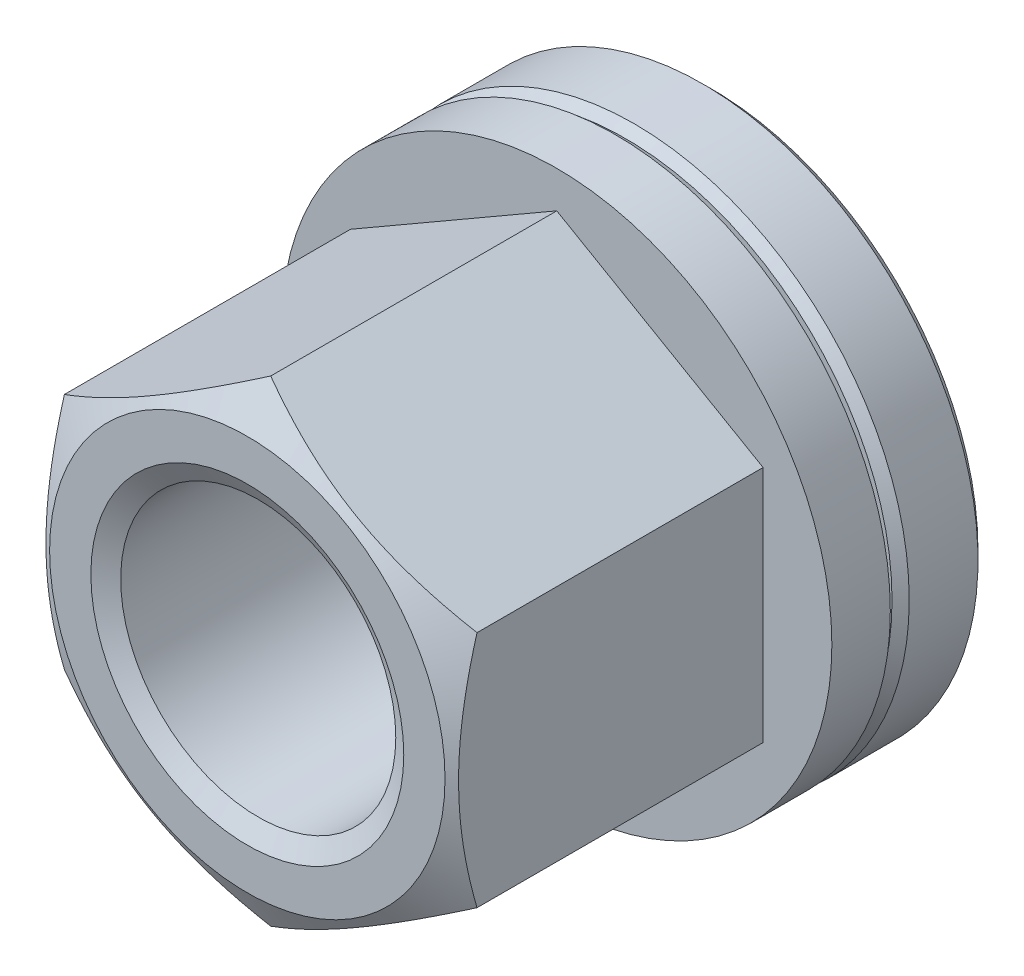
ISO-10303-21;
HEADER;
FILE_DESCRIPTION(('STEP AP214'),'2;1');
FILE_NAME('part.step','',(''),(''),'','','');
FILE_SCHEMA(('AUTOMOTIVE_DESIGN { 1 0 10303 214 1 1 1 1 }'));
ENDSEC;
DATA;
#1=APPLICATION_CONTEXT('core data for automotive mechanical design processes');
#2=APPLICATION_PROTOCOL_DEFINITION('international standard','automotive_design',2000,#1);
#3=PRODUCT_CONTEXT('',#1,'mechanical');
#4=PRODUCT('Part','Part','',(#3));
#5=PRODUCT_RELATED_PRODUCT_CATEGORY('part','',(#4));
#6=PRODUCT_DEFINITION_FORMATION('','',#4);
#7=PRODUCT_DEFINITION_CONTEXT('part definition',#1,'design');
#8=PRODUCT_DEFINITION('design','',#6,#7);
#9=PRODUCT_DEFINITION_SHAPE('','',#8);
#10=(LENGTH_UNIT() NAMED_UNIT(*) SI_UNIT(.MILLI.,.METRE.));
#11=(NAMED_UNIT(*) PLANE_ANGLE_UNIT() SI_UNIT($,.RADIAN.));
#12=(NAMED_UNIT(*) SI_UNIT($,.STERADIAN.) SOLID_ANGLE_UNIT());
#13=UNCERTAINTY_MEASURE_WITH_UNIT(LENGTH_MEASURE(1.E-05),#10,'distance_accuracy_value','');
#14=(GEOMETRIC_REPRESENTATION_CONTEXT(3) GLOBAL_UNCERTAINTY_ASSIGNED_CONTEXT((#13)) GLOBAL_UNIT_ASSIGNED_CONTEXT((#10,
#11,#12)) REPRESENTATION_CONTEXT('',''));
#15=CARTESIAN_POINT('',(0.,0.,0.));
#16=DIRECTION('',(0.,0.,1.));
#17=DIRECTION('',(1.,0.,0.));
#18=AXIS2_PLACEMENT_3D('',#15,#16,#17);
#19=CARTESIAN_POINT('',(0.,0.,0.));
#20=DIRECTION('',(0.,0.,-1.));
#21=DIRECTION('',(-1.,0.,0.));
#22=AXIS2_PLACEMENT_3D('',#19,#20,#21);
#23=CYLINDRICAL_SURFACE('',#22,9.5);
#24=CARTESIAN_POINT('',(0.,0.,0.5));
#25=DIRECTION('',(0.,0.,-1.));
#26=DIRECTION('',(-1.,0.,0.));
#27=AXIS2_PLACEMENT_3D('',#24,#25,#26);
#28=CIRCLE('',#27,9.5);
#29=CARTESIAN_POINT('',(-9.5,0.,0.5));
#30=VERTEX_POINT('',#29);
#31=EDGE_CURVE('E232',#30,#30,#28,.T.);
#32=ORIENTED_EDGE('',*,*,#31,.T.);
#33=EDGE_LOOP('',(#32));
#34=FACE_BOUND('',#33,.T.);
#35=CARTESIAN_POINT('',(0.,0.,3.0427143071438));
#36=DIRECTION('',(0.,0.,1.));
#37=DIRECTION('',(0.,1.,0.));
#38=AXIS2_PLACEMENT_3D('',#35,#36,#37);
#39=CIRCLE('',#38,9.5);
#40=CARTESIAN_POINT('',(9.50000000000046,0.,3.0427143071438));
#41=VERTEX_POINT('',#40);
#42=EDGE_CURVE('E9',#41,#41,#39,.F.);
#43=ORIENTED_EDGE('',*,*,#42,.F.);
#44=EDGE_LOOP('',(#43));
#45=FACE_BOUND('',#44,.T.);
#46=ADVANCED_FACE('F14',(#34,#45),#23,.F.);
#47=CARTESIAN_POINT('',(0.,14.7499999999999,5.00000000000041));
#48=DIRECTION('',(0.,0.,1.));
#49=DIRECTION('',(1.,0.,0.));
#50=AXIS2_PLACEMENT_3D('',#47,#48,#49);
#51=PLANE('',#50);
#52=CARTESIAN_POINT('',(0.,-1.3935318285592E-13,5.));
#53=DIRECTION('',(0.,0.,1.));
#54=DIRECTION('',(1.,0.,0.));
#55=AXIS2_PLACEMENT_3D('',#52,#53,#54);
#56=CIRCLE('',#55,15.5);
#57=CARTESIAN_POINT('',(15.5,-1.3935318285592E-13,5.));
#58=VERTEX_POINT('',#57);
#59=EDGE_CURVE('E243',#58,#58,#56,.T.);
#60=ORIENTED_EDGE('',*,*,#59,.T.);
#61=EDGE_LOOP('',(#60));
#62=FACE_BOUND('',#61,.T.);
#63=CARTESIAN_POINT('',(4.65013248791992E-13,-1.37046923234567E-13,5.));
#64=DIRECTION('',(0.,0.,1.));
#65=DIRECTION('',(0.,1.,0.));
#66=AXIS2_PLACEMENT_3D('',#63,#64,#65);
#67=CIRCLE('',#66,14.7744875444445);
#68=CARTESIAN_POINT('',(14.7744875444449,-1.37046923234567E-13,5.));
#69=VERTEX_POINT('',#68);
#70=EDGE_CURVE('E23',#69,#69,#67,.T.);
#71=ORIENTED_EDGE('',*,*,#70,.F.);
#72=EDGE_LOOP('',(#71));
#73=FACE_BOUND('',#72,.T.);
#74=ADVANCED_FACE('F201',(#62,#73),#51,.T.);
#75=CARTESIAN_POINT('',(0.,16.,4.45496504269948E-13));
#76=DIRECTION('',(0.,0.,-1.));
#77=DIRECTION('',(-1.,0.,0.));
#78=AXIS2_PLACEMENT_3D('',#75,#76,#77);
#79=PLANE('',#78);
#80=CARTESIAN_POINT('',(0.,0.,0.));
#81=DIRECTION('',(0.,0.,-1.));
#82=DIRECTION('',(-1.,0.,0.));
#83=AXIS2_PLACEMENT_3D('',#80,#81,#82);
#84=CIRCLE('',#83,10.);
#85=CARTESIAN_POINT('',(-10.,0.,0.));
#86=VERTEX_POINT('',#85);
#87=EDGE_CURVE('E231',#86,#86,#84,.F.);
#88=ORIENTED_EDGE('',*,*,#87,.T.);
#89=EDGE_LOOP('',(#88));
#90=FACE_BOUND('',#89,.T.);
#91=CARTESIAN_POINT('',(0.,0.,0.));
#92=DIRECTION('',(0.,0.,-1.));
#93=DIRECTION('',(-1.,0.,0.));
#94=AXIS2_PLACEMENT_3D('',#91,#92,#93);
#95=CIRCLE('',#94,15.5);
#96=CARTESIAN_POINT('',(-15.5,0.,0.));
#97=VERTEX_POINT('',#96);
#98=EDGE_CURVE('E229',#97,#97,#95,.T.);
#99=ORIENTED_EDGE('',*,*,#98,.T.);
#100=EDGE_LOOP('',(#99));
#101=FACE_BOUND('',#100,.T.);
#102=ADVANCED_FACE('F199',(#90,#101),#79,.T.);
#103=CARTESIAN_POINT('',(0.,0.,0.));
#104=DIRECTION('',(0.,0.,-1.));
#105=DIRECTION('',(-1.,0.,0.));
#106=AXIS2_PLACEMENT_3D('',#103,#104,#105);
#107=CYLINDRICAL_SURFACE('',#106,16.);
#108=CARTESIAN_POINT('',(0.,0.,0.500000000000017));
#109=DIRECTION('',(0.,0.,-1.));
#110=DIRECTION('',(-1.,0.,0.));
#111=AXIS2_PLACEMENT_3D('',#108,#109,#110);
#112=CIRCLE('',#111,16.);
#113=CARTESIAN_POINT('',(-16.,0.,0.500000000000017));
#114=VERTEX_POINT('',#113);
#115=EDGE_CURVE('E226',#114,#114,#112,.F.);
#116=ORIENTED_EDGE('',*,*,#115,.T.);
#117=EDGE_LOOP('',(#116));
#118=FACE_BOUND('',#117,.T.);
#119=CARTESIAN_POINT('',(0.,-1.25417864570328E-13,4.5));
#120=DIRECTION('',(0.,0.,1.));
#121=DIRECTION('',(1.,0.,0.));
#122=AXIS2_PLACEMENT_3D('',#119,#120,#121);
#123=CIRCLE('',#122,16.);
#124=CARTESIAN_POINT('',(16.,-1.25417864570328E-13,4.5));
#125=VERTEX_POINT('',#124);
#126=EDGE_CURVE('E235',#125,#125,#123,.F.);
#127=ORIENTED_EDGE('',*,*,#126,.T.);
#128=EDGE_LOOP('',(#127));
#129=FACE_BOUND('',#128,.T.);
#130=ADVANCED_FACE('F195',(#118,#129),#107,.T.);
#131=CARTESIAN_POINT('',(0.,0.,0.5));
#132=DIRECTION('',(0.,0.,-1.));
#133=DIRECTION('',(-1.,0.,0.));
#134=AXIS2_PLACEMENT_3D('',#131,#132,#133);
#135=CONICAL_SURFACE('',#134,9.5,0.785398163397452);
#136=ORIENTED_EDGE('',*,*,#87,.F.);
#137=EDGE_LOOP('',(#136));
#138=FACE_BOUND('',#137,.T.);
#139=ORIENTED_EDGE('',*,*,#31,.F.);
#140=EDGE_LOOP('',(#139));
#141=FACE_BOUND('',#140,.T.);
#142=ADVANCED_FACE('F198',(#138,#141),#135,.F.);
#143=CARTESIAN_POINT('',(0.,0.,0.));
#144=DIRECTION('',(0.,0.,1.));
#145=DIRECTION('',(1.,0.,0.));
#146=AXIS2_PLACEMENT_3D('',#143,#144,#145);
#147=CONICAL_SURFACE('',#146,15.5,0.785398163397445);
#148=ORIENTED_EDGE('',*,*,#115,.F.);
#149=EDGE_LOOP('',(#148));
#150=FACE_BOUND('',#149,.T.);
#151=ORIENTED_EDGE('',*,*,#98,.F.);
#152=EDGE_LOOP('',(#151));
#153=FACE_BOUND('',#152,.T.);
#154=ADVANCED_FACE('F212',(#150,#153),#147,.T.);
#155=CARTESIAN_POINT('',(0.,-1.25417864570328E-13,4.5));
#156=DIRECTION('',(0.,0.,-1.));
#157=DIRECTION('',(-1.,0.,0.));
#158=AXIS2_PLACEMENT_3D('',#155,#156,#157);
#159=CONICAL_SURFACE('',#158,16.,0.785398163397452);
#160=ORIENTED_EDGE('',*,*,#59,.F.);
#161=EDGE_LOOP('',(#160));
#162=FACE_BOUND('',#161,.T.);
#163=ORIENTED_EDGE('',*,*,#126,.F.);
#164=EDGE_LOOP('',(#163));
#165=FACE_BOUND('',#164,.T.);
#166=ADVANCED_FACE('F16',(#162,#165),#159,.T.);
#167=CARTESIAN_POINT('',(-15.9999999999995,-7.50200927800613E-13,27.));
#168=DIRECTION('',(0.,0.,-1.));
#169=DIRECTION('',(-1.,0.,0.));
#170=AXIS2_PLACEMENT_3D('',#167,#168,#169);
#171=PLANE('',#170);
#172=CARTESIAN_POINT('',(4.65013248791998E-13,-7.50200927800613E-13,27.));
#173=DIRECTION('',(0.,0.,1.));
#174=DIRECTION('',(1.,0.,0.));
#175=AXIS2_PLACEMENT_3D('',#172,#173,#174);
#176=CIRCLE('',#175,9.1);
#177=CARTESIAN_POINT('',(9.10000000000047,-7.50200927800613E-13,27.));
#178=VERTEX_POINT('',#177);
#179=EDGE_CURVE('E245',#178,#178,#176,.T.);
#180=ORIENTED_EDGE('',*,*,#179,.F.);
#181=EDGE_LOOP('',(#180));
#182=FACE_BOUND('',#181,.T.);
#183=CARTESIAN_POINT('',(4.65013248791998E-13,-7.50200927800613E-13,27.));
#184=DIRECTION('',(0.,0.,1.));
#185=DIRECTION('',(1.,0.,0.));
#186=AXIS2_PLACEMENT_3D('',#183,#184,#185);
#187=CIRCLE('',#186,11.5);
#188=CARTESIAN_POINT('',(11.5000000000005,-7.50200927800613E-13,27.));
#189=VERTEX_POINT('',#188);
#190=EDGE_CURVE('E86',#189,#189,#187,.T.);
#191=ORIENTED_EDGE('',*,*,#190,.T.);
#192=EDGE_LOOP('',(#191));
#193=FACE_BOUND('',#192,.T.);
#194=ADVANCED_FACE('F127',(#182,#193),#171,.F.);
#195=CARTESIAN_POINT('',(4.65013248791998E-13,-7.50200927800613E-13,27.));
#196=DIRECTION('',(0.,0.,-1.));
#197=DIRECTION('',(1.,0.,0.));
#198=AXIS2_PLACEMENT_3D('',#195,#196,#197);
#199=CONICAL_SURFACE('',#198,11.5,1.0471975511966);
#200=CARTESIAN_POINT('',(12.0002000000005,-6.92808776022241,25.6394614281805));
#201=CARTESIAN_POINT('',(11.7364142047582,-7.08038456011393,25.7273752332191));
#202=CARTESIAN_POINT('',(11.4716448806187,-7.23324920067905,25.8112988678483));
#203=CARTESIAN_POINT('',(10.9399829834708,-7.54020434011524,25.9700586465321));
#204=CARTESIAN_POINT('',(10.6730897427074,-7.69429522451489,26.0448918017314));
#205=CARTESIAN_POINT('',(9.86810959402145,-8.15905073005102,26.2543073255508));
#206=CARTESIAN_POINT('',(9.32684492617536,-8.4715500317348,26.3734216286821));
#207=CARTESIAN_POINT('',(8.51686717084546,-8.93919090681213,26.5130938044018));
#208=CARTESIAN_POINT('',(8.25057389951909,-9.0929353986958,26.5528810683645));
#209=CARTESIAN_POINT('',(7.71675440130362,-9.40113622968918,26.6196014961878));
#210=CARTESIAN_POINT('',(7.44922815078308,-9.5555925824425,26.6465344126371));
#211=CARTESIAN_POINT('',(6.91372963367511,-9.86476279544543,26.686856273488));
#212=CARTESIAN_POINT('',(6.64575827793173,-10.019476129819,26.7002613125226));
#213=CARTESIAN_POINT('',(6.10956726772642,-10.3290461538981,26.7132417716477));
#214=CARTESIAN_POINT('',(5.84134762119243,-10.4839028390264,26.7128176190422));
#215=CARTESIAN_POINT('',(5.33991062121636,-10.7734076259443,26.6991048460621));
#216=CARTESIAN_POINT('',(5.10665750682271,-10.9080763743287,26.6874888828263));
#217=CARTESIAN_POINT('',(4.64068775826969,-11.17710413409,26.6540168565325));
#218=CARTESIAN_POINT('',(4.40797116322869,-11.3114631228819,26.6321600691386));
#219=CARTESIAN_POINT('',(3.94320092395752,-11.5797983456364,26.5785874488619));
#220=CARTESIAN_POINT('',(3.71114798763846,-11.7137741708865,26.5468634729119));
#221=CARTESIAN_POINT('',(3.24813003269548,-11.9810977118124,26.4741130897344));
#222=CARTESIAN_POINT('',(3.01716508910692,-12.1144453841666,26.4330860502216));
#223=CARTESIAN_POINT('',(2.31605804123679,-12.5192297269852,26.295013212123));
#224=CARTESIAN_POINT('',(1.84794625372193,-12.7894941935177,26.1841999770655));
#225=CARTESIAN_POINT('',(0.918702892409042,-13.3259930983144,25.9326990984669));
#226=CARTESIAN_POINT('',(0.457559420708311,-13.5922344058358,25.7920705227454));
#227=CARTESIAN_POINT('',(-0.000199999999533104,-13.8565219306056,25.6394614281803));
#228=B_SPLINE_CURVE_WITH_KNOTS('',3,(#200,#201,#202,#203,#204,#205,#206,#207,#208,#209,#210,
#211,#212,#213,#214,#215,#216,#217,#218,#219,#220,#221,#222,#223,#224,#225,#226,#227),
.UNSPECIFIED.,.F.,.F.,(4,2,2,2,2,2,2,2,2,2,2,2,2,4),(0.,0.951004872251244,1.90232158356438,
3.80900466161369,4.7389455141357,5.66890426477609,6.59775529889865,7.5265776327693,
8.33514643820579,9.14377244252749,9.95306755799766,10.7624176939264,12.4167102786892,
14.0677556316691),.UNSPECIFIED.);
#229=CARTESIAN_POINT('',(12.0000000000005,-6.92820323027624,25.6395280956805));
#230=VERTEX_POINT('',#229);
#231=CARTESIAN_POINT('',(4.64943577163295E-13,-13.8564064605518,25.6395280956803));
#232=VERTEX_POINT('',#231);
#233=EDGE_CURVE('E68',#230,#232,#228,.T.);
#234=ORIENTED_EDGE('',*,*,#233,.F.);
#235=CARTESIAN_POINT('',(12.0000000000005,-18.8434664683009,20.7415149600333));
#236=CARTESIAN_POINT('',(12.0000000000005,-18.5803728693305,20.869635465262));
#237=CARTESIAN_POINT('',(12.0000000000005,-18.316976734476,20.9971344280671));
#238=CARTESIAN_POINT('',(12.0000000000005,-17.7895163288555,21.2507489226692));
#239=CARTESIAN_POINT('',(12.0000000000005,-17.5254520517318,21.3768644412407));
#240=CARTESIAN_POINT('',(12.0000000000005,-16.7320951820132,21.7529570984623));
#241=CARTESIAN_POINT('',(12.0000000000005,-16.2017129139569,22.0006440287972));
#242=CARTESIAN_POINT('',(12.0000000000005,-15.1347002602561,22.4897396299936));
#243=CARTESIAN_POINT('',(12.0000000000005,-14.5980517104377,22.731108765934));
#244=CARTESIAN_POINT('',(12.0000000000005,-13.5205668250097,23.2042777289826));
#245=CARTESIAN_POINT('',(12.0000000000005,-12.979730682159,23.4360779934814));
#246=CARTESIAN_POINT('',(12.0000000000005,-11.8748518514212,23.8951286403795));
#247=CARTESIAN_POINT('',(12.0000000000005,-11.3106375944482,24.1219681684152));
#248=CARTESIAN_POINT('',(12.0000000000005,-10.1756915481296,24.559038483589));
#249=CARTESIAN_POINT('',(12.0000000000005,-9.60495904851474,24.7692674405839));
#250=CARTESIAN_POINT('',(12.0000000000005,-8.4570804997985,25.1677658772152));
#251=CARTESIAN_POINT('',(12.0000000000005,-7.879949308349,25.3560778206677));
#252=CARTESIAN_POINT('',(12.0000000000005,-6.71735864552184,25.7048671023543));
#253=CARTESIAN_POINT('',(12.0000000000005,-6.1319017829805,25.8653529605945));
#254=CARTESIAN_POINT('',(12.0000000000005,-5.24893794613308,26.0790923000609));
#255=CARTESIAN_POINT('',(12.0000000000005,-4.95464380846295,26.1456926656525));
#256=CARTESIAN_POINT('',(12.0000000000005,-4.36400259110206,26.2691204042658));
#257=CARTESIAN_POINT('',(12.0000000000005,-4.06765555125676,26.3259479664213));
#258=CARTESIAN_POINT('',(12.0000000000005,-3.47309729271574,26.4288417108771));
#259=CARTESIAN_POINT('',(12.0000000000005,-3.17488612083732,26.4749081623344));
#260=CARTESIAN_POINT('',(12.0000000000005,-2.57689471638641,26.555370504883));
#261=CARTESIAN_POINT('',(12.0000000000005,-2.27711454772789,26.5897668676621));
#262=CARTESIAN_POINT('',(12.0000000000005,-1.68042126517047,26.6457608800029));
#263=CARTESIAN_POINT('',(12.0000000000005,-1.38352381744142,26.6675244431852));
#264=CARTESIAN_POINT('',(12.0000000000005,-0.789074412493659,26.6984661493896));
#265=CARTESIAN_POINT('',(12.0000000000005,-0.491522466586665,26.7076445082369));
#266=CARTESIAN_POINT('',(12.0000000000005,0.103706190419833,26.7131962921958));
#267=CARTESIAN_POINT('',(12.0000000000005,0.401382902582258,26.7095696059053));
#268=CARTESIAN_POINT('',(12.0000000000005,0.99631272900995,26.6896024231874));
#269=CARTESIAN_POINT('',(12.0000000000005,1.29356582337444,26.6732613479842));
#270=CARTESIAN_POINT('',(12.0000000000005,2.00084774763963,26.619604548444));
#271=CARTESIAN_POINT('',(12.0000000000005,2.41045862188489,26.5766520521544));
#272=CARTESIAN_POINT('',(12.0000000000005,3.22677371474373,26.4688945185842));
#273=CARTESIAN_POINT('',(12.0000000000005,3.63347755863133,26.4040867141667));
#274=CARTESIAN_POINT('',(12.0000000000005,4.84867435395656,26.1803061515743));
#275=CARTESIAN_POINT('',(12.0000000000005,5.65184651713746,25.9920112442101));
#276=CARTESIAN_POINT('',(12.0000000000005,6.85343086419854,25.663712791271));
#277=CARTESIAN_POINT('',(12.0000000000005,7.25802232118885,25.5450104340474));
#278=CARTESIAN_POINT('',(12.0000000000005,8.06327871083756,25.294841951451));
#279=CARTESIAN_POINT('',(12.0000000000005,8.46394361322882,25.1633757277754));
#280=CARTESIAN_POINT('',(12.0000000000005,9.2614699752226,24.8898250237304));
#281=CARTESIAN_POINT('',(12.0000000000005,9.65833249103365,24.7477435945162));
#282=CARTESIAN_POINT('',(12.0000000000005,10.448735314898,24.4546778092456));
#283=CARTESIAN_POINT('',(12.0000000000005,10.8422756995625,24.3036936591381));
#284=CARTESIAN_POINT('',(12.0000000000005,11.9058125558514,23.8840612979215));
#285=CARTESIAN_POINT('',(12.0000000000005,12.5729740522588,23.6082346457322));
#286=CARTESIAN_POINT('',(12.0000000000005,13.900410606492,23.0404224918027));
#287=CARTESIAN_POINT('',(12.0000000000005,14.560684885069,22.7484351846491));
#288=CARTESIAN_POINT('',(12.0000000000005,15.875939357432,22.1521484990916));
#289=CARTESIAN_POINT('',(12.0000000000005,16.5309174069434,21.8478444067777));
#290=CARTESIAN_POINT('',(12.0000000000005,17.8363996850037,21.2298861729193));
#291=CARTESIAN_POINT('',(12.0000000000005,18.4869040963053,20.9162324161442));
#292=CARTESIAN_POINT('',(12.0000000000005,19.785376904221,20.2811092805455));
#293=CARTESIAN_POINT('',(12.0000000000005,20.4333395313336,19.9596281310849));
#294=CARTESIAN_POINT('',(12.0000000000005,21.7263534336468,19.3108596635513));
#295=CARTESIAN_POINT('',(12.0000000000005,22.3714046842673,18.9835722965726));
#296=CARTESIAN_POINT('',(12.0000000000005,23.6589770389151,18.3244087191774));
#297=CARTESIAN_POINT('',(12.0000000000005,24.3014986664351,17.9925335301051));
#298=CARTESIAN_POINT('',(12.0000000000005,25.5845625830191,17.3249879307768));
#299=CARTESIAN_POINT('',(12.0000000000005,26.2251048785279,16.9893175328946));
#300=CARTESIAN_POINT('',(12.0000000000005,28.0080736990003,16.0494373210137));
#301=CARTESIAN_POINT('',(12.0000000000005,29.1487016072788,15.4418162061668));
#302=CARTESIAN_POINT('',(12.0000000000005,31.426167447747,14.2193596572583));
#303=CARTESIAN_POINT('',(12.0000000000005,32.5630051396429,13.6045237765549));
#304=CARTESIAN_POINT('',(12.0000000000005,34.8299510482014,12.3715440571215));
#305=CARTESIAN_POINT('',(12.0000000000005,35.9600690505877,11.7534181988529));
#306=CARTESIAN_POINT('',(12.0000000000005,37.6535122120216,10.8231817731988));
#307=CARTESIAN_POINT('',(12.0000000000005,38.2176822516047,10.5126072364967));
#308=CARTESIAN_POINT('',(12.0000000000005,39.3455194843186,9.8905480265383));
#309=CARTESIAN_POINT('',(12.0000000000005,39.9091866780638,9.57906335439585));
#310=CARTESIAN_POINT('',(12.0000000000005,40.4726332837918,9.26718006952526));
#311=B_SPLINE_CURVE_WITH_KNOTS('',3,(#235,#236,#237,#238,#239,#240,#241,#242,#243,#244,#245,
#246,#247,#248,#249,#250,#251,#252,#253,#254,#255,#256,#257,#258,#259,#260,#261,#262,#263,#264,
#265,#266,#267,#268,#269,#270,#271,#272,#273,#274,#275,#276,#277,#278,#279,#280,#281,#282,#283,
#284,#285,#286,#287,#288,#289,#290,#291,#292,#293,#294,#295,#296,#297,#298,#299,#300,#301,#302,
#303,#304,#305,#306,#307,#308,#309,#310),.UNSPECIFIED.,.F.,.F.,(4,2,2,2,2,2,2,2,2,2,2,2,2,2,2,2,
2,2,2,2,2,2,2,2,2,2,2,2,2,2,2,2,2,2,2,2,2,4),(0.,0.877892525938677,1.75579343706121,
3.51184350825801,5.27706280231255,7.0422013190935,8.86632199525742,10.6906433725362,
12.5113691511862,14.3315364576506,15.236608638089,16.141663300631,17.0466953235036,
17.9516907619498,18.8445145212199,19.7373229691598,20.6301391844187,21.5229960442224,
22.7578738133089,23.9929079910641,26.46419349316,27.7290162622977,28.9938487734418,
30.2583191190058,31.5227602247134,33.6882343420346,35.8539508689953,38.0205042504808,
40.1869685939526,42.3569211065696,44.5268919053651,46.6963871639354,48.8658753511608,
52.7429626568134,56.6202912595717,60.4846314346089,62.416650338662,64.3486668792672),.UNSPECIFIED.);
#312=CARTESIAN_POINT('',(12.0000000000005,6.92820323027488,25.6395280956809));
#313=VERTEX_POINT('',#312);
#314=EDGE_CURVE('E72',#313,#230,#311,.F.);
#315=ORIENTED_EDGE('',*,*,#314,.F.);
#316=CARTESIAN_POINT('',(-0.000199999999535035,13.8565219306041,25.6394614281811));
#317=CARTESIAN_POINT('',(0.263585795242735,13.7042251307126,25.7273752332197));
#318=CARTESIAN_POINT('',(0.528355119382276,13.5513604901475,25.8112988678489));
#319=CARTESIAN_POINT('',(1.06001701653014,13.2444053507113,25.9700586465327));
#320=CARTESIAN_POINT('',(1.32691025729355,13.0903144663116,26.044891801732));
#321=CARTESIAN_POINT('',(2.13189040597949,12.6255589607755,26.2543073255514));
#322=CARTESIAN_POINT('',(2.67315507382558,12.3130596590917,26.3734216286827));
#323=CARTESIAN_POINT('',(3.48313282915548,11.8454187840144,26.5130938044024));
#324=CARTESIAN_POINT('',(3.74942610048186,11.6916742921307,26.5528810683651));
#325=CARTESIAN_POINT('',(4.28324559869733,11.3834734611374,26.6196014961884));
#326=CARTESIAN_POINT('',(4.55077184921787,11.229017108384,26.6465344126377));
#327=CARTESIAN_POINT('',(5.08627036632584,10.9198468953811,26.6868562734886));
#328=CARTESIAN_POINT('',(5.35424172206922,10.7651335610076,26.7002613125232));
#329=CARTESIAN_POINT('',(5.89043273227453,10.4555635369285,26.7132417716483));
#330=CARTESIAN_POINT('',(6.15865237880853,10.3007068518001,26.7128176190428));
#331=CARTESIAN_POINT('',(6.66008937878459,10.0112020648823,26.6991048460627));
#332=CARTESIAN_POINT('',(6.89334249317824,9.87653331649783,26.6874888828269));
#333=CARTESIAN_POINT('',(7.35931224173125,9.60750555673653,26.654016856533));
#334=CARTESIAN_POINT('',(7.59202883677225,9.47314656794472,26.6321600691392));
#335=CARTESIAN_POINT('',(8.05679907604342,9.20481134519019,26.5785874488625));
#336=CARTESIAN_POINT('',(8.28885201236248,9.07083551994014,26.5468634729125));
#337=CARTESIAN_POINT('',(8.75186996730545,8.80351197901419,26.474113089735));
#338=CARTESIAN_POINT('',(8.98283491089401,8.67016430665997,26.4330860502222));
#339=CARTESIAN_POINT('',(9.68394195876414,8.26537996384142,26.2950132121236));
#340=CARTESIAN_POINT('',(10.152053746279,7.99511549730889,26.1841999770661));
#341=CARTESIAN_POINT('',(11.0812971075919,7.45861659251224,25.9326990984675));
#342=CARTESIAN_POINT('',(11.5424405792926,7.19237528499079,25.792070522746));
#343=CARTESIAN_POINT('',(12.0002000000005,6.92808776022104,25.6394614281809));
#344=B_SPLINE_CURVE_WITH_KNOTS('',3,(#316,#317,#318,#319,#320,#321,#322,#323,#324,#325,#326,
#327,#328,#329,#330,#331,#332,#333,#334,#335,#336,#337,#338,#339,#340,#341,#342,#343),
.UNSPECIFIED.,.F.,.F.,(4,2,2,2,2,2,2,2,2,2,2,2,2,4),(0.,0.951004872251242,1.90232158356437,
3.80900466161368,4.73894551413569,5.66890426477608,6.59775529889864,7.52657763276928,
8.33514643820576,9.14377244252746,9.95306755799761,10.7624176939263,12.4167102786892,
14.0677556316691),.UNSPECIFIED.);
#345=CARTESIAN_POINT('',(4.5942969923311E-13,13.8564064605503,25.6395280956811));
#346=VERTEX_POINT('',#345);
#347=EDGE_CURVE('E85',#346,#313,#344,.T.);
#348=ORIENTED_EDGE('',*,*,#347,.F.);
#349=CARTESIAN_POINT('',(-12.0001999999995,6.92808776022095,25.6394614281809));
#350=CARTESIAN_POINT('',(-11.7364142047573,7.08038456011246,25.7273752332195));
#351=CARTESIAN_POINT('',(-11.4716448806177,7.23324920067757,25.8112988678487));
#352=CARTESIAN_POINT('',(-10.9399829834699,7.54020434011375,25.9700586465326));
#353=CARTESIAN_POINT('',(-10.6730897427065,7.69429522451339,26.0448918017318));
#354=CARTESIAN_POINT('',(-9.86810959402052,8.15905073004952,26.2543073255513));
#355=CARTESIAN_POINT('',(-9.32684492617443,8.47155003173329,26.3734216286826));
#356=CARTESIAN_POINT('',(-8.51686717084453,8.93919090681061,26.5130938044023));
#357=CARTESIAN_POINT('',(-8.25057389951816,9.09293539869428,26.552881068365));
#358=CARTESIAN_POINT('',(-7.71675440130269,9.40113622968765,26.6196014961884));
#359=CARTESIAN_POINT('',(-7.44922815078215,9.55559258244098,26.6465344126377));
#360=CARTESIAN_POINT('',(-6.91372963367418,9.86476279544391,26.6868562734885));
#361=CARTESIAN_POINT('',(-6.6457582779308,10.0194761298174,26.7002613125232));
#362=CARTESIAN_POINT('',(-6.10956726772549,10.3290461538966,26.7132417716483));
#363=CARTESIAN_POINT('',(-5.8413476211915,10.4839028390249,26.7128176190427));
#364=CARTESIAN_POINT('',(-5.33991062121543,10.7734076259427,26.6991048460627));
#365=CARTESIAN_POINT('',(-5.10665750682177,10.9080763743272,26.687488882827));
#366=CARTESIAN_POINT('',(-4.64068775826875,11.1771041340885,26.6540168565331));
#367=CARTESIAN_POINT('',(-4.40797116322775,11.3114631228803,26.6321600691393));
#368=CARTESIAN_POINT('',(-3.94320092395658,11.5797983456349,26.5785874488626));
#369=CARTESIAN_POINT('',(-3.71114798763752,11.7137741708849,26.5468634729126));
#370=CARTESIAN_POINT('',(-3.24813003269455,11.9810977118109,26.4741130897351));
#371=CARTESIAN_POINT('',(-3.01716508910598,12.1144453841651,26.4330860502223));
#372=CARTESIAN_POINT('',(-2.31605804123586,12.5192297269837,26.2950132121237));
#373=CARTESIAN_POINT('',(-1.847946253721,12.7894941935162,26.1841999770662));
#374=CARTESIAN_POINT('',(-0.918702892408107,13.3259930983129,25.9326990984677));
#375=CARTESIAN_POINT('',(-0.457559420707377,13.5922344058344,25.7920705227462));
#376=CARTESIAN_POINT('',(0.000200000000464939,13.8565219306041,25.6394614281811));
#377=B_SPLINE_CURVE_WITH_KNOTS('',3,(#349,#350,#351,#352,#353,#354,#355,#356,#357,#358,#359,
#360,#361,#362,#363,#364,#365,#366,#367,#368,#369,#370,#371,#372,#373,#374,#375,#376),
.UNSPECIFIED.,.F.,.F.,(4,2,2,2,2,2,2,2,2,2,2,2,2,4),(0.,0.951004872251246,1.90232158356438,
3.80900466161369,4.73894551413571,5.6689042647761,6.59775529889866,7.52657763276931,
8.3351464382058,9.1437724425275,9.95306755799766,10.7624176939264,12.4167102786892,
14.0677556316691),.UNSPECIFIED.);
#378=CARTESIAN_POINT('',(-11.9999999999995,6.9282032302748,25.6395280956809));
#379=VERTEX_POINT('',#378);
#380=EDGE_CURVE('E149',#379,#346,#377,.T.);
#381=ORIENTED_EDGE('',*,*,#380,.F.);
#382=CARTESIAN_POINT('',(-11.9999999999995,-18.8434664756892,20.7415149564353));
#383=CARTESIAN_POINT('',(-11.9999999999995,-18.5803728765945,20.869635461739));
#384=CARTESIAN_POINT('',(-11.9999999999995,-18.3169767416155,20.9971344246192));
#385=CARTESIAN_POINT('',(-11.9999999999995,-17.7895163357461,21.2507489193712));
#386=CARTESIAN_POINT('',(-11.9999999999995,-17.5254520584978,21.3768644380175));
#387=CARTESIAN_POINT('',(-11.9999999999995,-16.7320951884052,21.7529570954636));
#388=CARTESIAN_POINT('',(-11.9999999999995,-16.2017129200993,22.0006440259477));
#389=CARTESIAN_POINT('',(-11.9999999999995,-15.1347002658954,22.4897396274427));
#390=CARTESIAN_POINT('',(-11.9999999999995,-14.5980517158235,22.7311087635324));
#391=CARTESIAN_POINT('',(-11.9999999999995,-13.5205668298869,23.2042777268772));
#392=CARTESIAN_POINT('',(-11.9999999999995,-12.979730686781,23.4360779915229));
#393=CARTESIAN_POINT('',(-11.9999999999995,-11.8748518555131,23.8951286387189));
#394=CARTESIAN_POINT('',(-11.9999999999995,-11.3106375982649,24.1219681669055));
#395=CARTESIAN_POINT('',(-11.9999999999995,-10.1756915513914,24.5590384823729));
#396=CARTESIAN_POINT('',(-11.9999999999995,-9.60495905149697,24.7692674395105));
#397=CARTESIAN_POINT('',(-11.9999999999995,-8.45708050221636,25.1677658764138));
#398=CARTESIAN_POINT('',(-11.9999999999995,-7.87994931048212,25.3560778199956));
#399=CARTESIAN_POINT('',(-11.9999999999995,-6.71735864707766,25.7048671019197));
#400=CARTESIAN_POINT('',(-11.9999999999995,-6.13190178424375,25.8653529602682));
#401=CARTESIAN_POINT('',(-11.9999999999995,-5.24893794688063,26.0790922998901));
#402=CARTESIAN_POINT('',(-11.9999999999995,-4.95464380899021,26.1456926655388));
#403=CARTESIAN_POINT('',(-11.9999999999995,-4.3640025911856,26.2691204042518));
#404=CARTESIAN_POINT('',(-11.9999999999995,-4.06765555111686,26.32594796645));
#405=CARTESIAN_POINT('',(-11.9999999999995,-3.47309729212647,26.4288417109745));
#406=CARTESIAN_POINT('',(-11.9999999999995,-3.17488612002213,26.4749081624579));
#407=CARTESIAN_POINT('',(-11.9999999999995,-2.57689471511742,26.5553705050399));
#408=CARTESIAN_POINT('',(-11.9999999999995,-2.27711454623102,26.5897668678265));
#409=CARTESIAN_POINT('',(-11.9999999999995,-1.68042126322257,26.6457608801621));
#410=CARTESIAN_POINT('',(-11.9999999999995,-1.38352381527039,26.667524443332));
#411=CARTESIAN_POINT('',(-11.9999999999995,-0.789074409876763,26.698466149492));
#412=CARTESIAN_POINT('',(-11.9999999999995,-0.491522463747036,26.7076445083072));
#413=CARTESIAN_POINT('',(-11.9999999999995,0.103706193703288,26.7131962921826));
#414=CARTESIAN_POINT('',(-11.9999999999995,0.401382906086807,26.7095696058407));
#415=CARTESIAN_POINT('',(-11.9999999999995,0.996312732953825,26.689602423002));
#416=CARTESIAN_POINT('',(-11.9999999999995,1.29356582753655,26.6732613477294));
#417=CARTESIAN_POINT('',(-11.9999999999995,2.00084775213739,26.6196045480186));
#418=CARTESIAN_POINT('',(-11.9999999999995,2.41045862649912,26.5766520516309));
#419=CARTESIAN_POINT('',(-11.9999999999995,3.2267737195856,26.4688945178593));
#420=CARTESIAN_POINT('',(-11.9999999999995,3.63347756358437,26.4040867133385));
#421=CARTESIAN_POINT('',(-11.9999999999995,4.848674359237,26.1803061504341));
#422=CARTESIAN_POINT('',(-11.9999999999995,5.65184652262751,25.9920112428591));
#423=CARTESIAN_POINT('',(-11.9999999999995,6.85343087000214,25.663712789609));
#424=CARTESIAN_POINT('',(-11.9999999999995,7.25802232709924,25.545010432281));
#425=CARTESIAN_POINT('',(-11.9999999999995,8.06327871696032,25.2948419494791));
#426=CARTESIAN_POINT('',(-11.9999999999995,8.46394361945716,25.1633757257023));
#427=CARTESIAN_POINT('',(-11.9999999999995,9.2614699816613,24.8898250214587));
#428=CARTESIAN_POINT('',(-11.9999999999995,9.65833249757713,24.747743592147));
#429=CARTESIAN_POINT('',(-11.9999999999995,10.4487353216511,24.4546778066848));
#430=CARTESIAN_POINT('',(-11.9999999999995,10.8422757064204,24.3036936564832));
#431=CARTESIAN_POINT('',(-11.9999999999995,11.9058125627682,23.8840612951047));
#432=CARTESIAN_POINT('',(-11.9999999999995,12.5729740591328,23.608234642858));
#433=CARTESIAN_POINT('',(-11.9999999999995,13.9004106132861,23.0404224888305));
#434=CARTESIAN_POINT('',(-11.9999999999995,14.5606848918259,22.7484351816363));
#435=CARTESIAN_POINT('',(-11.9999999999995,15.8759393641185,22.1521484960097));
#436=CARTESIAN_POINT('',(-11.9999999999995,16.5309174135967,21.8478444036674));
#437=CARTESIAN_POINT('',(-11.9999999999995,17.8363996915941,21.2298861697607));
#438=CARTESIAN_POINT('',(-11.9999999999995,18.486904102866,20.9162324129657));
#439=CARTESIAN_POINT('',(-11.9999999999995,19.7853769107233,20.2811092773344));
#440=CARTESIAN_POINT('',(-11.9999999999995,20.4333395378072,19.9596281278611));
#441=CARTESIAN_POINT('',(-11.9999999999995,21.7263534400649,19.3108596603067));
#442=CARTESIAN_POINT('',(-11.9999999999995,22.3714046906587,18.98357229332));
#443=CARTESIAN_POINT('',(-11.9999999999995,23.6589770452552,18.3244087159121));
#444=CARTESIAN_POINT('',(-11.9999999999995,24.3014986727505,17.9925335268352));
#445=CARTESIAN_POINT('',(-11.9999999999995,25.5845625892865,17.3249879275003));
#446=CARTESIAN_POINT('',(-11.9999999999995,26.2251048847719,16.9893175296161));
#447=CARTESIAN_POINT('',(-11.9999999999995,28.0080737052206,16.0494373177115));
#448=CARTESIAN_POINT('',(-11.9999999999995,29.1487016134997,15.4418162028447));
#449=CARTESIAN_POINT('',(-11.9999999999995,31.4261674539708,14.2193596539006));
#450=CARTESIAN_POINT('',(-11.9999999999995,32.5630051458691,13.6045237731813));
#451=CARTESIAN_POINT('',(-11.9999999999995,34.8299510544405,12.3715440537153));
#452=CARTESIAN_POINT('',(-11.9999999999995,35.9600690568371,11.7534181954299));
#453=CARTESIAN_POINT('',(-11.9999999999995,37.6535122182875,10.8231817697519));
#454=CARTESIAN_POINT('',(-11.9999999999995,38.2176822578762,10.512607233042));
#455=CARTESIAN_POINT('',(-11.9999999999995,39.3455194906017,9.89054802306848));
#456=CARTESIAN_POINT('',(-11.9999999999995,39.9091866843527,9.57906335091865));
#457=CARTESIAN_POINT('',(-11.9999999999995,40.4726332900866,9.26718006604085));
#458=B_SPLINE_CURVE_WITH_KNOTS('',3,(#382,#383,#384,#385,#386,#387,#388,#389,#390,#391,#392,
#393,#394,#395,#396,#397,#398,#399,#400,#401,#402,#403,#404,#405,#406,#407,#408,#409,#410,#411,
#412,#413,#414,#415,#416,#417,#418,#419,#420,#421,#422,#423,#424,#425,#426,#427,#428,#429,#430,
#431,#432,#433,#434,#435,#436,#437,#438,#439,#440,#441,#442,#443,#444,#445,#446,#447,#448,#449,
#450,#451,#452,#453,#454,#455,#456,#457),.UNSPECIFIED.,.F.,.F.,(4,2,2,2,2,2,2,2,2,2,2,2,2,2,2,2,
2,2,2,2,2,2,2,2,2,2,2,2,2,2,2,2,2,2,2,2,2,4),(0.,0.877892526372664,1.75579343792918,
3.51184350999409,5.27706280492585,7.04220132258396,8.86632199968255,10.6906433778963,
12.5113691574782,14.3315364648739,15.2366086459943,16.1416633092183,17.0466953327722,
17.9516907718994,18.8445145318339,19.737322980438,20.6301391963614,21.5229960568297,
22.7578738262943,23.9929080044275,26.464193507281,27.7290162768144,28.9938487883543,
30.2583191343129,31.5227602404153,33.6882343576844,35.8539508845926,38.0205042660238,
40.1869686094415,42.3569211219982,44.5268919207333,46.6963871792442,48.8658753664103,
52.7429626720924,56.6202912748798,60.4846314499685,62.4166503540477,64.348666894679),.UNSPECIFIED.);
#459=CARTESIAN_POINT('',(-11.9999999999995,-6.92820323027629,25.6395280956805));
#460=VERTEX_POINT('',#459);
#461=EDGE_CURVE('E156',#460,#379,#458,.T.);
#462=ORIENTED_EDGE('',*,*,#461,.F.);
#463=CARTESIAN_POINT('',(0.000200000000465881,-13.8565219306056,25.6394614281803));
#464=CARTESIAN_POINT('',(-0.263585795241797,-13.7042251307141,25.7273752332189));
#465=CARTESIAN_POINT('',(-0.528355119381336,-13.551360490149,25.8112988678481));
#466=CARTESIAN_POINT('',(-1.0600170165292,-13.2444053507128,25.9700586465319));
#467=CARTESIAN_POINT('',(-1.32691025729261,-13.0903144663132,26.0448918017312));
#468=CARTESIAN_POINT('',(-2.13189040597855,-12.625558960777,26.2543073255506));
#469=CARTESIAN_POINT('',(-2.67315507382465,-12.3130596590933,26.373421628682));
#470=CARTESIAN_POINT('',(-3.48313282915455,-11.845418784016,26.5130938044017));
#471=CARTESIAN_POINT('',(-3.74942610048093,-11.6916742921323,26.5528810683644));
#472=CARTESIAN_POINT('',(-4.2832455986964,-11.3834734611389,26.6196014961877));
#473=CARTESIAN_POINT('',(-4.55077184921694,-11.2290171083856,26.6465344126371));
#474=CARTESIAN_POINT('',(-5.08627036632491,-10.9198468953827,26.6868562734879));
#475=CARTESIAN_POINT('',(-5.35424172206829,-10.7651335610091,26.7002613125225));
#476=CARTESIAN_POINT('',(-5.89043273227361,-10.45556353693,26.7132417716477));
#477=CARTESIAN_POINT('',(-6.15865237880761,-10.3007068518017,26.7128176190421));
#478=CARTESIAN_POINT('',(-6.66008937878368,-10.0112020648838,26.6991048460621));
#479=CARTESIAN_POINT('',(-6.89334249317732,-9.87653331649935,26.6874888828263));
#480=CARTESIAN_POINT('',(-7.35931224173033,-9.60750555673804,26.6540168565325));
#481=CARTESIAN_POINT('',(-7.59202883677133,-9.47314656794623,26.6321600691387));
#482=CARTESIAN_POINT('',(-8.0567990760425,-9.20481134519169,26.578587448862));
#483=CARTESIAN_POINT('',(-8.28885201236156,-9.07083551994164,26.546863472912));
#484=CARTESIAN_POINT('',(-8.75186996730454,-8.80351197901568,26.4741130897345));
#485=CARTESIAN_POINT('',(-8.9828349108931,-8.67016430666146,26.4330860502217));
#486=CARTESIAN_POINT('',(-9.68394195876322,-8.26537996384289,26.2950132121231));
#487=CARTESIAN_POINT('',(-10.1520537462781,-7.99511549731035,26.1841999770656));
#488=CARTESIAN_POINT('',(-11.081297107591,-7.45861659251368,25.9326990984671));
#489=CARTESIAN_POINT('',(-11.5424405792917,-7.19237528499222,25.7920705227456));
#490=CARTESIAN_POINT('',(-12.0001999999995,-6.92808776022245,25.6394614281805));
#491=B_SPLINE_CURVE_WITH_KNOTS('',3,(#463,#464,#465,#466,#467,#468,#469,#470,#471,#472,#473,
#474,#475,#476,#477,#478,#479,#480,#481,#482,#483,#484,#485,#486,#487,#488,#489,#490),
.UNSPECIFIED.,.F.,.F.,(4,2,2,2,2,2,2,2,2,2,2,2,2,4),(0.,0.95100487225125,1.90232158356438,
3.8090046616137,4.73894551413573,5.66890426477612,6.59775529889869,7.52657763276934,
8.33514643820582,9.14377244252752,9.95306755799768,10.7624176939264,12.4167102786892,
14.0677556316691),.UNSPECIFIED.);
#492=EDGE_CURVE('E31',#232,#460,#491,.T.);
#493=ORIENTED_EDGE('',*,*,#492,.F.);
#494=EDGE_LOOP('',(#234,#315,#348,#381,#462,#493));
#495=FACE_BOUND('',#494,.T.);
#496=ORIENTED_EDGE('',*,*,#190,.F.);
#497=EDGE_LOOP('',(#496));
#498=FACE_BOUND('',#497,.T.);
#499=ADVANCED_FACE('F70',(#495,#498),#199,.T.);
#500=CARTESIAN_POINT('',(-11.9999999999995,-6.92820323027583,8.99999999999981));
#501=DIRECTION('',(-0.5,-0.86602540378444,0.));
#502=DIRECTION('',(0.86602540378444,-0.5,0.));
#503=AXIS2_PLACEMENT_3D('',#500,#501,#502);
#504=PLANE('',#503);
#505=DIRECTION('',(0.,0.,1.));
#506=VECTOR('',#505,1.);
#507=CARTESIAN_POINT('',(4.64943577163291E-13,-13.8564064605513,8.99999999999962));
#508=LINE('',#507,#506);
#509=CARTESIAN_POINT('',(4.64943577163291E-13,-13.8564064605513,8.99999999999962));
#510=VERTEX_POINT('',#509);
#511=EDGE_CURVE('E90',#510,#232,#508,.T.);
#512=ORIENTED_EDGE('',*,*,#511,.T.);
#513=ORIENTED_EDGE('',*,*,#492,.T.);
#514=DIRECTION('',(0.,0.,1.));
#515=VECTOR('',#514,1.);
#516=CARTESIAN_POINT('',(-11.9999999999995,-6.92820323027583,8.99999999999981));
#517=LINE('',#516,#515);
#518=CARTESIAN_POINT('',(-11.9999999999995,-6.92820323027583,8.99999999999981));
#519=VERTEX_POINT('',#518);
#520=EDGE_CURVE('E103',#519,#460,#517,.T.);
#521=ORIENTED_EDGE('',*,*,#520,.F.);
#522=DIRECTION('',(0.86602540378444,-0.5,0.));
#523=VECTOR('',#522,1.);
#524=CARTESIAN_POINT('',(-11.9999999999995,-6.92820323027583,8.99999999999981));
#525=LINE('',#524,#523);
#526=EDGE_CURVE('E425',#519,#510,#525,.T.);
#527=ORIENTED_EDGE('',*,*,#526,.T.);
#528=EDGE_LOOP('',(#512,#513,#521,#527));
#529=FACE_BOUND('',#528,.T.);
#530=ADVANCED_FACE('F126',(#529),#504,.T.);
#531=CARTESIAN_POINT('',(4.64943577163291E-13,-13.8564064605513,8.99999999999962));
#532=DIRECTION('',(0.5,-0.866025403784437,0.));
#533=DIRECTION('',(0.866025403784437,0.5,0.));
#534=AXIS2_PLACEMENT_3D('',#531,#532,#533);
#535=PLANE('',#534);
#536=DIRECTION('',(0.,0.,1.));
#537=VECTOR('',#536,1.);
#538=CARTESIAN_POINT('',(12.0000000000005,-6.92820323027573,8.99999999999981));
#539=LINE('',#538,#537);
#540=CARTESIAN_POINT('',(12.0000000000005,-6.92820323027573,8.99999999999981));
#541=VERTEX_POINT('',#540);
#542=EDGE_CURVE('E82',#541,#230,#539,.T.);
#543=ORIENTED_EDGE('',*,*,#542,.T.);
#544=ORIENTED_EDGE('',*,*,#233,.T.);
#545=ORIENTED_EDGE('',*,*,#511,.F.);
#546=DIRECTION('',(0.866025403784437,0.5,0.));
#547=VECTOR('',#546,1.);
#548=CARTESIAN_POINT('',(4.64943577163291E-13,-13.8564064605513,8.99999999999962));
#549=LINE('',#548,#547);
#550=EDGE_CURVE('E89',#510,#541,#549,.T.);
#551=ORIENTED_EDGE('',*,*,#550,.T.);
#552=EDGE_LOOP('',(#543,#544,#545,#551));
#553=FACE_BOUND('',#552,.T.);
#554=ADVANCED_FACE('F88',(#553),#535,.T.);
#555=CARTESIAN_POINT('',(12.0000000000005,-6.92820323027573,8.99999999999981));
#556=DIRECTION('',(1.,0.,0.));
#557=DIRECTION('',(0.,0.,-1.));
#558=AXIS2_PLACEMENT_3D('',#555,#556,#557);
#559=PLANE('',#558);
#560=DIRECTION('',(0.,0.,1.));
#561=VECTOR('',#560,1.);
#562=CARTESIAN_POINT('',(12.0000000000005,6.92820323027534,9.0000000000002));
#563=LINE('',#562,#561);
#564=CARTESIAN_POINT('',(12.0000000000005,6.92820323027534,9.0000000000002));
#565=VERTEX_POINT('',#564);
#566=EDGE_CURVE('E84',#565,#313,#563,.T.);
#567=ORIENTED_EDGE('',*,*,#566,.T.);
#568=ORIENTED_EDGE('',*,*,#314,.T.);
#569=ORIENTED_EDGE('',*,*,#542,.F.);
#570=DIRECTION('',(0.,1.,0.));
#571=VECTOR('',#570,1.);
#572=CARTESIAN_POINT('',(12.0000000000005,-6.92820323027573,8.99999999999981));
#573=LINE('',#572,#571);
#574=EDGE_CURVE('E39',#541,#565,#573,.T.);
#575=ORIENTED_EDGE('',*,*,#574,.T.);
#576=EDGE_LOOP('',(#567,#568,#569,#575));
#577=FACE_BOUND('',#576,.T.);
#578=ADVANCED_FACE('F81',(#577),#559,.T.);
#579=CARTESIAN_POINT('',(12.0000000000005,6.92820323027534,9.0000000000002));
#580=DIRECTION('',(0.499999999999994,0.866025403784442,0.));
#581=DIRECTION('',(-0.866025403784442,0.5,0.));
#582=AXIS2_PLACEMENT_3D('',#579,#580,#581);
#583=PLANE('',#582);
#584=DIRECTION('',(0.,0.,1.));
#585=VECTOR('',#584,1.);
#586=CARTESIAN_POINT('',(4.64964643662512E-13,13.8564064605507,9.00000000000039));
#587=LINE('',#586,#585);
#588=CARTESIAN_POINT('',(4.64964643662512E-13,13.8564064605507,9.00000000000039));
#589=VERTEX_POINT('',#588);
#590=EDGE_CURVE('E92',#589,#346,#587,.T.);
#591=ORIENTED_EDGE('',*,*,#590,.T.);
#592=ORIENTED_EDGE('',*,*,#347,.T.);
#593=ORIENTED_EDGE('',*,*,#566,.F.);
#594=DIRECTION('',(-0.866025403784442,0.499999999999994,0.));
#595=VECTOR('',#594,1.);
#596=CARTESIAN_POINT('',(12.0000000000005,6.92820323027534,9.0000000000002));
#597=LINE('',#596,#595);
#598=EDGE_CURVE('E430',#565,#589,#597,.T.);
#599=ORIENTED_EDGE('',*,*,#598,.T.);
#600=EDGE_LOOP('',(#591,#592,#593,#599));
#601=FACE_BOUND('',#600,.T.);
#602=ADVANCED_FACE('F333',(#601),#583,.T.);
#603=CARTESIAN_POINT('',(4.64964643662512E-13,13.8564064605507,9.00000000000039));
#604=DIRECTION('',(-0.5,0.86602540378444,0.));
#605=DIRECTION('',(-0.86602540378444,-0.5,0.));
#606=AXIS2_PLACEMENT_3D('',#603,#604,#605);
#607=PLANE('',#606);
#608=DIRECTION('',(0.,0.,1.));
#609=VECTOR('',#608,1.);
#610=CARTESIAN_POINT('',(-11.9999999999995,6.92820323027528,9.0000000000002));
#611=LINE('',#610,#609);
#612=CARTESIAN_POINT('',(-11.9999999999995,6.92820323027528,9.0000000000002));
#613=VERTEX_POINT('',#612);
#614=EDGE_CURVE('E100',#613,#379,#611,.T.);
#615=ORIENTED_EDGE('',*,*,#614,.T.);
#616=ORIENTED_EDGE('',*,*,#380,.T.);
#617=ORIENTED_EDGE('',*,*,#590,.F.);
#618=DIRECTION('',(-0.86602540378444,-0.5,0.));
#619=VECTOR('',#618,1.);
#620=CARTESIAN_POINT('',(4.64964643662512E-13,13.8564064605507,9.00000000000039));
#621=LINE('',#620,#619);
#622=EDGE_CURVE('E435',#589,#613,#621,.T.);
#623=ORIENTED_EDGE('',*,*,#622,.T.);
#624=EDGE_LOOP('',(#615,#616,#617,#623));
#625=FACE_BOUND('',#624,.T.);
#626=ADVANCED_FACE('F173',(#625),#607,.T.);
#627=CARTESIAN_POINT('',(-11.9999999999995,6.92820323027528,9.0000000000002));
#628=DIRECTION('',(-1.,0.,0.));
#629=DIRECTION('',(0.,-1.,0.));
#630=AXIS2_PLACEMENT_3D('',#627,#628,#629);
#631=PLANE('',#630);
#632=ORIENTED_EDGE('',*,*,#520,.T.);
#633=ORIENTED_EDGE('',*,*,#461,.T.);
#634=ORIENTED_EDGE('',*,*,#614,.F.);
#635=DIRECTION('',(0.,-1.,0.));
#636=VECTOR('',#635,1.);
#637=CARTESIAN_POINT('',(-11.9999999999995,6.92820323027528,9.0000000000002));
#638=LINE('',#637,#636);
#639=EDGE_CURVE('E94',#613,#519,#638,.T.);
#640=ORIENTED_EDGE('',*,*,#639,.T.);
#641=EDGE_LOOP('',(#632,#633,#634,#640));
#642=FACE_BOUND('',#641,.T.);
#643=ADVANCED_FACE('F168',(#642),#631,.T.);
#644=CARTESIAN_POINT('',(4.65013248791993E-13,-2.48529469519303E-13,9.));
#645=DIRECTION('',(0.,0.,1.));
#646=DIRECTION('',(1.,0.,0.));
#647=AXIS2_PLACEMENT_3D('',#644,#645,#646);
#648=PLANE('',#647);
#649=ORIENTED_EDGE('',*,*,#639,.F.);
#650=ORIENTED_EDGE('',*,*,#622,.F.);
#651=ORIENTED_EDGE('',*,*,#598,.F.);
#652=ORIENTED_EDGE('',*,*,#574,.F.);
#653=ORIENTED_EDGE('',*,*,#550,.F.);
#654=ORIENTED_EDGE('',*,*,#526,.F.);
#655=EDGE_LOOP('',(#649,#650,#651,#652,#653,#654));
#656=FACE_BOUND('',#655,.T.);
#657=CARTESIAN_POINT('',(4.65013248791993E-13,-2.48529469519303E-13,9.));
#658=DIRECTION('',(0.,0.,1.));
#659=DIRECTION('',(1.,0.,0.));
#660=AXIS2_PLACEMENT_3D('',#657,#658,#659);
#661=CIRCLE('',#660,16.);
#662=CARTESIAN_POINT('',(16.0000000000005,-2.48529469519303E-13,9.));
#663=VERTEX_POINT('',#662);
#664=EDGE_CURVE('E106',#663,#663,#661,.T.);
#665=ORIENTED_EDGE('',*,*,#664,.T.);
#666=EDGE_LOOP('',(#665));
#667=FACE_BOUND('',#666,.T.);
#668=ADVANCED_FACE('F172',(#656,#667),#648,.T.);
#669=CARTESIAN_POINT('',(4.65013248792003E-13,-1.19613111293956E-12,43.));
#670=DIRECTION('',(0.,0.,1.));
#671=DIRECTION('',(1.,0.,0.));
#672=AXIS2_PLACEMENT_3D('',#669,#670,#671);
#673=CYLINDRICAL_SURFACE('',#672,16.);
#674=CARTESIAN_POINT('',(4.65013248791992E-13,-1.53769305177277E-13,5.6));
#675=DIRECTION('',(0.,0.,1.));
#676=DIRECTION('',(1.,0.,0.));
#677=AXIS2_PLACEMENT_3D('',#674,#675,#676);
#678=CIRCLE('',#677,16.);
#679=CARTESIAN_POINT('',(16.0000000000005,-1.53769305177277E-13,5.6));
#680=VERTEX_POINT('',#679);
#681=EDGE_CURVE('E107',#680,#680,#678,.T.);
#682=ORIENTED_EDGE('',*,*,#681,.T.);
#683=EDGE_LOOP('',(#682));
#684=FACE_BOUND('',#683,.T.);
#685=ORIENTED_EDGE('',*,*,#664,.F.);
#686=EDGE_LOOP('',(#685));
#687=FACE_BOUND('',#686,.T.);
#688=ADVANCED_FACE('F178',(#684,#687),#673,.T.);
#689=CARTESIAN_POINT('',(4.65013248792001E-13,-1.02134779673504E-12,36.7287648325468));
#690=DIRECTION('',(0.,0.,1.));
#691=DIRECTION('',(1.,0.,0.));
#692=AXIS2_PLACEMENT_3D('',#689,#690,#691);
#693=SPHERICAL_SURFACE('',#692,35.);
#694=CARTESIAN_POINT('',(14.7744875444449,-1.37046923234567E-13,5.));
#695=CARTESIAN_POINT('',(14.7873735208,-1.37214156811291E-13,5.00600035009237));
#696=CARTESIAN_POINT('',(14.8002558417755,-1.37381609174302E-13,5.01200855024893));
#697=CARTESIAN_POINT('',(14.8260131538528,-1.37716951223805E-13,5.02404064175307));
#698=CARTESIAN_POINT('',(14.8388881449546,-1.37884840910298E-13,5.03006453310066));
#699=CARTESIAN_POINT('',(14.8646307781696,-1.38221057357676E-13,5.0421279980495));
#700=CARTESIAN_POINT('',(14.8774984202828,-1.38389384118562E-13,5.04816757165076));
#701=CARTESIAN_POINT('',(14.9032263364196,-1.38726474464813E-13,5.06026239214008));
#702=CARTESIAN_POINT('',(14.9160866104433,-1.38895238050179E-13,5.06631763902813));
#703=CARTESIAN_POINT('',(14.9417997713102,-1.39233201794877E-13,5.07844379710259));
#704=CARTESIAN_POINT('',(14.9546526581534,-1.39402401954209E-13,5.08451470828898));
#705=CARTESIAN_POINT('',(14.9803510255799,-1.39741238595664E-13,5.09667218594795));
#706=CARTESIAN_POINT('',(14.9931965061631,-1.39910875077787E-13,5.10275875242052));
#707=CARTESIAN_POINT('',(15.0188800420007,-1.40250584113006E-13,5.11494753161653));
#708=CARTESIAN_POINT('',(15.0317180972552,-1.40420656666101E-13,5.12104974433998));
#709=CARTESIAN_POINT('',(15.0573867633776,-1.40761237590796E-13,5.13326980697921));
#710=CARTESIAN_POINT('',(15.0702173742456,-1.40931745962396E-13,5.139387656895));
#711=CARTESIAN_POINT('',(15.0958711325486,-1.41273198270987E-13,5.15163898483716));
#712=CARTESIAN_POINT('',(15.1086942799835,-1.41444142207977E-13,5.15777246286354));
#713=CARTESIAN_POINT('',(15.1343330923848,-1.41786465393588E-13,5.17005503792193));
#714=CARTESIAN_POINT('',(15.1471487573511,-1.41957844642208E-13,5.17620413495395));
#715=CARTESIAN_POINT('',(15.1727725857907,-1.42301038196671E-13,5.18851793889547));
#716=CARTESIAN_POINT('',(15.185580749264,-1.42472852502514E-13,5.19468264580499));
#717=CARTESIAN_POINT('',(15.2111895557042,-1.4281691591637E-13,5.20702766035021));
#718=CARTESIAN_POINT('',(15.2239901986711,-1.42989165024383E-13,5.21320796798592));
#719=CARTESIAN_POINT('',(15.2495839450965,-1.4333409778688E-13,5.22558417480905));
#720=CARTESIAN_POINT('',(15.2623770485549,-1.43506781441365E-13,5.23178007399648));
#721=CARTESIAN_POINT('',(15.2879556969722,-1.43852583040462E-13,5.24418745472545));
#722=CARTESIAN_POINT('',(15.3007412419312,-1.44025700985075E-13,5.250398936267));
#723=CARTESIAN_POINT('',(15.3263047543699,-1.44372370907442E-13,5.26283747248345));
#724=CARTESIAN_POINT('',(15.3390827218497,-1.44545922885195E-13,5.26906452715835));
#725=CARTESIAN_POINT('',(15.3646310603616,-1.44893460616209E-13,5.28153420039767));
#726=CARTESIAN_POINT('',(15.3774014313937,-1.45067446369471E-13,5.28777681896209));
#727=CARTESIAN_POINT('',(15.402934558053,-1.45415851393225E-13,5.30027761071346));
#728=CARTESIAN_POINT('',(15.4156973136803,-1.45590270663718E-13,5.30653578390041));
#729=CARTESIAN_POINT('',(15.441215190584,-1.45939542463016E-13,5.3190676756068));
#730=CARTESIAN_POINT('',(15.4539703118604,-1.46114394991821E-13,5.32534139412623));
#731=CARTESIAN_POINT('',(15.479472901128,-1.4646453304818E-13,5.33790436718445));
#732=CARTESIAN_POINT('',(15.4922203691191,-1.46639818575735E-13,5.34419362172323));
#733=CARTESIAN_POINT('',(15.5177076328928,-1.46990822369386E-13,5.35678765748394));
#734=CARTESIAN_POINT('',(15.5304474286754,-1.47166540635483E-13,5.36309243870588));
#735=CARTESIAN_POINT('',(15.5559193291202,-1.47518409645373E-13,5.37571751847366));
#736=CARTESIAN_POINT('',(15.5686514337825,-1.47694560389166E-13,5.3820378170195));
#737=CARTESIAN_POINT('',(15.5941079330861,-1.48047294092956E-13,5.39469392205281));
#738=CARTESIAN_POINT('',(15.6068323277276,-1.48223877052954E-13,5.40102972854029));
#739=CARTESIAN_POINT('',(15.6322733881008,-1.48577474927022E-13,5.41371684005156));
#740=CARTESIAN_POINT('',(15.6449900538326,-1.48754489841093E-13,5.42006814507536));
#741=CARTESIAN_POINT('',(15.6704156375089,-1.49108951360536E-13,5.43278624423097));
#742=CARTESIAN_POINT('',(15.6831245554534,-1.49286397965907E-13,5.43915303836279));
#743=CARTESIAN_POINT('',(15.7085346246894,-1.49641722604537E-13,5.45190210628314));
#744=CARTESIAN_POINT('',(15.7212357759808,-1.49819600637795E-13,5.45828438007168));
#745=CARTESIAN_POINT('',(15.7466302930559,-1.50175787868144E-13,5.47106439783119));
#746=CARTESIAN_POINT('',(15.7593236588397,-1.50354097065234E-13,5.47746214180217));
#747=CARTESIAN_POINT('',(15.7847025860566,-1.50711146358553E-13,5.49027309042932));
#748=CARTESIAN_POINT('',(15.7973881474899,-1.50889886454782E-13,5.49668629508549));
#749=CARTESIAN_POINT('',(15.8227514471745,-1.51247797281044E-13,5.50952815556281));
#750=CARTESIAN_POINT('',(15.835429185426,-1.51426968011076E-13,5.51595681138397));
#751=CARTESIAN_POINT('',(15.8607768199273,-1.51785739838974E-13,5.5288295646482));
#752=CARTESIAN_POINT('',(15.8734467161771,-1.5196534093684E-13,5.5352736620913));
#753=CARTESIAN_POINT('',(15.8987786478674,-1.52324973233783E-13,5.54817728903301));
#754=CARTESIAN_POINT('',(15.9114406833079,-1.5250500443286E-13,5.55463681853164));
#755=CARTESIAN_POINT('',(15.9367568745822,-1.52865496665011E-13,5.56757129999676));
#756=CARTESIAN_POINT('',(15.9494110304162,-1.53045957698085E-13,5.57404625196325));
#757=CARTESIAN_POINT('',(15.9747114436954,-1.53407309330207E-13,5.58701156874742));
#758=CARTESIAN_POINT('',(15.9873577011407,-1.53588199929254E-13,5.59350193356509));
#759=CARTESIAN_POINT('',(16.0000000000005,-1.53769305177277E-13,5.6));
#760=B_SPLINE_CURVE_WITH_KNOTS('',3,(#694,#695,#696,#697,#698,#699,#700,#701,#702,#703,#704,
#705,#706,#707,#708,#709,#710,#711,#712,#713,#714,#715,#716,#717,#718,#719,#720,#721,#722,#723,
#724,#725,#726,#727,#728,#729,#730,#731,#732,#733,#734,#735,#736,#737,#738,#739,#740,#741,#742,
#743,#744,#745,#746,#747,#748,#749,#750,#751,#752,#753,#754,#755,#756,#757,#758,#759),
.UNSPECIFIED.,.F.,.F.,(4,2,2,2,2,2,2,2,2,2,2,2,2,2,2,2,2,2,2,2,2,2,2,2,2,2,2,2,2,2,2,2,4),(0.,
0.0426435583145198,0.085287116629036,0.127930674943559,0.17057423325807,0.213217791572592,
0.255861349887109,0.29850490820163,0.341148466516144,0.383792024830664,0.426435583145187,
0.469079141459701,0.511722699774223,0.554366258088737,0.597009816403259,0.639653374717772,
0.682296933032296,0.724940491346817,0.767584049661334,0.810227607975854,0.852871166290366,
0.89551472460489,0.938158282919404,0.980801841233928,1.02344539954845,1.06608895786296,
1.10873251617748,1.151376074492,1.19401963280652,1.23666319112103,1.27930674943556,
1.32195030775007,1.36459386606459),.UNSPECIFIED.);
#761=EDGE_CURVE('BSEAM181',#69,#680,#760,.T.);
#762=ORIENTED_EDGE('',*,*,#70,.T.);
#763=ORIENTED_EDGE('',*,*,#681,.F.);
#764=ORIENTED_EDGE('',*,*,#761,.T.);
#765=ORIENTED_EDGE('',*,*,#761,.F.);
#766=EDGE_LOOP('',(#762,#764,#763,#765));
#767=FACE_BOUND('',#766,.T.);
#768=ADVANCED_FACE('F181',(#767),#693,.T.);
#769=CARTESIAN_POINT('',(4.65013248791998E-13,-7.50200927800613E-13,27.));
#770=DIRECTION('',(0.,0.,1.));
#771=DIRECTION('',(1.,0.,0.));
#772=AXIS2_PLACEMENT_3D('',#769,#770,#771);
#773=CONICAL_SURFACE('',#772,9.1,1.04719755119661);
#774=CARTESIAN_POINT('',(4.65013248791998E-13,-7.32500696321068E-13,26.3649147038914));
#775=DIRECTION('',(0.,0.,1.));
#776=DIRECTION('',(0.,1.,0.));
#777=AXIS2_PLACEMENT_3D('',#774,#775,#776);
#778=CIRCLE('',#777,8.);
#779=CARTESIAN_POINT('',(4.65013248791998E-13,7.99999999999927,26.3649147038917));
#780=VERTEX_POINT('',#779);
#781=EDGE_CURVE('E238',#780,#780,#778,.F.);
#782=ORIENTED_EDGE('',*,*,#781,.T.);
#783=EDGE_LOOP('',(#782));
#784=FACE_BOUND('',#783,.T.);
#785=ORIENTED_EDGE('',*,*,#179,.T.);
#786=EDGE_LOOP('',(#785));
#787=FACE_BOUND('',#786,.T.);
#788=ADVANCED_FACE('F185',(#784,#787),#773,.F.);
#789=CARTESIAN_POINT('',(4.65013248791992E-13,-1.13487889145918E-13,4.15470053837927));
#790=DIRECTION('',(0.,0.,-1.));
#791=DIRECTION('',(-1.,0.,0.));
#792=AXIS2_PLACEMENT_3D('',#789,#790,#791);
#793=CONICAL_SURFACE('',#792,7.1,1.0471975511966);
#794=CARTESIAN_POINT('',(4.65013248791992E-13,0.,3.6350852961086));
#795=DIRECTION('',(0.,0.,-1.));
#796=DIRECTION('',(0.,-1.,0.));
#797=AXIS2_PLACEMENT_3D('',#794,#795,#796);
#798=CIRCLE('',#797,8.);
#799=CARTESIAN_POINT('',(4.65013248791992E-13,-8.0000000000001,3.63508529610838));
#800=VERTEX_POINT('',#799);
#801=EDGE_CURVE('E18',#800,#800,#798,.F.);
#802=ORIENTED_EDGE('',*,*,#801,.T.);
#803=EDGE_LOOP('',(#802));
#804=FACE_BOUND('',#803,.T.);
#805=CARTESIAN_POINT('',(4.65013248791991E-13,0.,3.));
#806=DIRECTION('',(0.,0.,1.));
#807=DIRECTION('',(1.,0.,0.));
#808=AXIS2_PLACEMENT_3D('',#805,#806,#807);
#809=CIRCLE('',#808,9.1);
#810=CARTESIAN_POINT('',(9.10000000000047,0.,3.));
#811=VERTEX_POINT('',#810);
#812=EDGE_CURVE('E248',#811,#811,#809,.T.);
#813=ORIENTED_EDGE('',*,*,#812,.F.);
#814=EDGE_LOOP('',(#813));
#815=FACE_BOUND('',#814,.T.);
#816=ADVANCED_FACE('F128',(#804,#815),#793,.F.);
#817=CARTESIAN_POINT('',(-7.99999999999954,0.,3.));
#818=DIRECTION('',(0.,0.,1.));
#819=DIRECTION('',(1.,0.,0.));
#820=AXIS2_PLACEMENT_3D('',#817,#818,#819);
#821=PLANE('',#820);
#822=ORIENTED_EDGE('',*,*,#812,.T.);
#823=EDGE_LOOP('',(#822));
#824=FACE_BOUND('',#823,.T.);
#825=CARTESIAN_POINT('',(4.65013248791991E-13,0.,3.));
#826=DIRECTION('',(0.,0.,1.));
#827=DIRECTION('',(1.,0.,0.));
#828=AXIS2_PLACEMENT_3D('',#825,#826,#827);
#829=CIRCLE('',#828,9.34721471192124);
#830=CARTESIAN_POINT('',(9.34721471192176,0.,3.));
#831=VERTEX_POINT('',#830);
#832=EDGE_CURVE('E77',#831,#831,#829,.T.);
#833=ORIENTED_EDGE('',*,*,#832,.F.);
#834=EDGE_LOOP('',(#833));
#835=FACE_BOUND('',#834,.T.);
#836=ADVANCED_FACE('F188',(#824,#835),#821,.F.);
#837=CARTESIAN_POINT('',(9.50000000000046,0.,3.0427143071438));
#838=CARTESIAN_POINT('',(9.4984094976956,0.,3.0422657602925));
#839=CARTESIAN_POINT('',(9.49681896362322,0.,3.04181732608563));
#840=CARTESIAN_POINT('',(9.49363783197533,0.,3.04092068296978));
#841=CARTESIAN_POINT('',(9.49204723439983,0.,3.04047247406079));
#842=CARTESIAN_POINT('',(9.48886597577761,0.,3.03957628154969));
#843=CARTESIAN_POINT('',(9.48727531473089,0.,3.03912829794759));
#844=CARTESIAN_POINT('',(9.48409392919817,0.,3.03823255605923));
#845=CARTESIAN_POINT('',(9.48250320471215,0.,3.03778479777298));
#846=CARTESIAN_POINT('',(9.47932169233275,0.,3.03688950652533));
#847=CARTESIAN_POINT('',(9.47773090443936,0.,3.03644197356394));
#848=CARTESIAN_POINT('',(9.47454926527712,0.,3.03554713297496));
#849=CARTESIAN_POINT('',(9.47295841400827,0.,3.03509982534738));
#850=CARTESIAN_POINT('',(9.46977664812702,0.,3.03420543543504));
#851=CARTESIAN_POINT('',(9.46818573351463,0.,3.03375835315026));
#852=CARTESIAN_POINT('',(9.46500384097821,0.,3.03286441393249));
#853=CARTESIAN_POINT('',(9.46341286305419,0.,3.03241755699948));
#854=CARTESIAN_POINT('',(9.46023084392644,0.,3.03152406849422));
#855=CARTESIAN_POINT('',(9.45863980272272,0.,3.03107743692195));
#856=CARTESIAN_POINT('',(9.45545765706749,0.,3.03018439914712));
#857=CARTESIAN_POINT('',(9.45386655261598,0.,3.02973799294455));
#858=CARTESIAN_POINT('',(9.45068428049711,0.,3.02884540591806));
#859=CARTESIAN_POINT('',(9.44909311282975,0.,3.02839922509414));
#860=CARTESIAN_POINT('',(9.44591071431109,0.,3.02750708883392));
#861=CARTESIAN_POINT('',(9.44431948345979,0.,3.02706113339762));
#862=CARTESIAN_POINT('',(9.44113695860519,0.,3.02616944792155));
#863=CARTESIAN_POINT('',(9.43954566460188,0.,3.02572371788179));
#864=CARTESIAN_POINT('',(9.43636301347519,0.,3.02483248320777));
#865=CARTESIAN_POINT('',(9.43477165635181,0.,3.02438697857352));
#866=CARTESIAN_POINT('',(9.43158887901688,0.,3.02349619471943));
#867=CARTESIAN_POINT('',(9.42999745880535,0.,3.02305091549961));
#868=CARTESIAN_POINT('',(9.42681455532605,0.,3.02216058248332));
#869=CARTESIAN_POINT('',(9.42522307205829,0.,3.02171552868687));
#870=CARTESIAN_POINT('',(9.42204004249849,0.,3.02082564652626));
#871=CARTESIAN_POINT('',(9.42044849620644,0.,3.0203808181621));
#872=CARTESIAN_POINT('',(9.41726534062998,0.,3.01949138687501));
#873=CARTESIAN_POINT('',(9.41567373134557,0.,3.01904678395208));
#874=CARTESIAN_POINT('',(9.41249044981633,0.,3.01815780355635));
#875=CARTESIAN_POINT('',(9.4108987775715,0.,3.01771342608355));
#876=CARTESIAN_POINT('',(9.40771537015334,0.,3.01682489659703));
#877=CARTESIAN_POINT('',(9.40612363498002,0.,3.0163807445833));
#878=CARTESIAN_POINT('',(9.40294010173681,0.,3.01549266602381));
#879=CARTESIAN_POINT('',(9.40134830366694,0.,3.01504873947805));
#880=CARTESIAN_POINT('',(9.39816464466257,0.,3.0141611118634));
#881=CARTESIAN_POINT('',(9.39657278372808,0.,3.01371741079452));
#882=CARTESIAN_POINT('',(9.39338899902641,0.,3.01283023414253));
#883=CARTESIAN_POINT('',(9.39179707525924,0.,3.01238675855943));
#884=CARTESIAN_POINT('',(9.38861316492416,0.,3.0115000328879));
#885=CARTESIAN_POINT('',(9.38702117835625,0.,3.01105678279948));
#886=CARTESIAN_POINT('',(9.38383714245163,0.,3.0101705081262));
#887=CARTESIAN_POINT('',(9.38224509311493,0.,3.00972748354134));
#888=CARTESIAN_POINT('',(9.37906093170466,0.,3.00884165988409));
#889=CARTESIAN_POINT('',(9.37746881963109,0.,3.0083988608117));
#890=CARTESIAN_POINT('',(9.37428453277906,0.,3.00751348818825));
#891=CARTESIAN_POINT('',(9.37269235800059,0.,3.0070709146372));
#892=CARTESIAN_POINT('',(9.36950794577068,0.,3.00618599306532));
#893=CARTESIAN_POINT('',(9.36791570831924,0.,3.00574364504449));
#894=CARTESIAN_POINT('',(9.36473117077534,0.,3.00485917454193));
#895=CARTESIAN_POINT('',(9.36313887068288,0.,3.0044170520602));
#896=CARTESIAN_POINT('',(9.35995420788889,0.,3.00353303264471));
#897=CARTESIAN_POINT('',(9.35836184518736,0.,3.00309113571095));
#898=CARTESIAN_POINT('',(9.35517705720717,0.,3.00220756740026));
#899=CARTESIAN_POINT('',(9.35358463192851,0.,3.00176589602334));
#900=CARTESIAN_POINT('',(9.35039971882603,0.,3.00088277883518));
#901=CARTESIAN_POINT('',(9.3488072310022,0.,3.00044133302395));
#902=CARTESIAN_POINT('',(9.34721471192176,0.,3.));
#903=B_SPLINE_CURVE_WITH_KNOTS('',3,(#837,#838,#839,#840,#841,#842,#843,#844,#845,#846,#847,
#848,#849,#850,#851,#852,#853,#854,#855,#856,#857,#858,#859,#860,#861,#862,#863,#864,#865,#866,
#867,#868,#869,#870,#871,#872,#873,#874,#875,#876,#877,#878,#879,#880,#881,#882,#883,#884,#885,
#886,#887,#888,#889,#890,#891,#892,#893,#894,#895,#896,#897,#898,#899,#900,#901,#902),
.UNSPECIFIED.,.F.,.F.,(4,2,2,2,2,2,2,2,2,2,2,2,2,2,2,2,2,2,2,2,2,2,2,2,2,2,2,2,2,2,2,2,4),(0.,
0.00495762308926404,0.00991524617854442,0.0148728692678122,0.0198304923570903,
0.0247881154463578,0.0297457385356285,0.0347033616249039,0.0396609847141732,0.044618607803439,
0.0495762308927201,0.0545338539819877,0.059491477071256,0.064449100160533,0.0694067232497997,
0.0743643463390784,0.0793219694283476,0.0842795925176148,0.0892372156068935,0.0941948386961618,
0.0991524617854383,0.104110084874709,0.109067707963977,0.114025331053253,0.118982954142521,
0.123940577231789,0.128898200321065,0.133855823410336,0.138813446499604,0.143771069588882,
0.148728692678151,0.153686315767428,0.158643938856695),.UNSPECIFIED.);
#904=EDGE_CURVE('BSEAM187',#41,#831,#903,.T.);
#905=ORIENTED_EDGE('',*,*,#42,.T.);
#906=ORIENTED_EDGE('',*,*,#832,.T.);
#907=ORIENTED_EDGE('',*,*,#904,.T.);
#908=ORIENTED_EDGE('',*,*,#904,.F.);
#909=EDGE_LOOP('',(#905,#907,#906,#908));
#910=FACE_BOUND('',#909,.T.);
#911=ADVANCED_FACE('F187',(#910),#693,.T.);
#912=CARTESIAN_POINT('',(4.6501324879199E-13,0.,-4.44089209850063E-13));
#913=DIRECTION('',(0.,0.,1.));
#914=DIRECTION('',(0.,1.,0.));
#915=AXIS2_PLACEMENT_3D('',#912,#913,#914);
#916=CYLINDRICAL_SURFACE('',#915,8.);
#917=ORIENTED_EDGE('',*,*,#801,.F.);
#918=EDGE_LOOP('',(#917));
#919=FACE_BOUND('',#918,.T.);
#920=ORIENTED_EDGE('',*,*,#781,.F.);
#921=EDGE_LOOP('',(#920));
#922=FACE_BOUND('',#921,.T.);
#923=ADVANCED_FACE('F222',(#919,#922),#916,.F.);
#924=CLOSED_SHELL('',(#46,#74,#102,#130,#142,#154,#166,#194,#499,#530,#554,#578,#602,#626,#643,
#668,#688,#768,#788,#816,#836,#911,#923));
#925=MANIFOLD_SOLID_BREP('B1',#924);
#926=ADVANCED_BREP_SHAPE_REPRESENTATION('',(#18,#925),#14);
#927=SHAPE_DEFINITION_REPRESENTATION(#9,#926);
ENDSEC;
END-ISO-10303-21;
